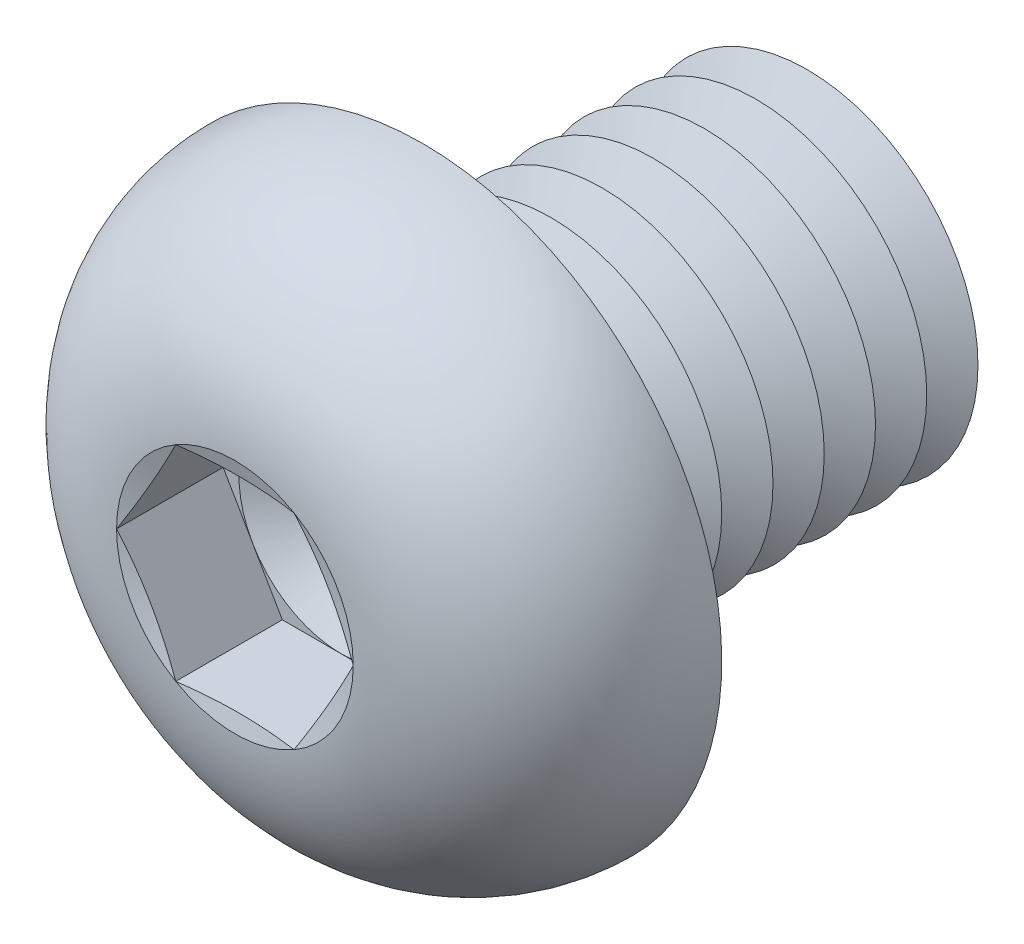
ISO-10303-21;
HEADER;
FILE_DESCRIPTION(('STEP AP214'),'2;1');
FILE_NAME('part.step','',(''),(''),'','','');
FILE_SCHEMA(('AUTOMOTIVE_DESIGN { 1 0 10303 214 1 1 1 1 }'));
ENDSEC;
DATA;
#1=APPLICATION_CONTEXT('core data for automotive mechanical design processes');
#2=APPLICATION_PROTOCOL_DEFINITION('international standard','automotive_design',2000,#1);
#3=PRODUCT_CONTEXT('',#1,'mechanical');
#4=PRODUCT('Part','Part','',(#3));
#5=PRODUCT_RELATED_PRODUCT_CATEGORY('part','',(#4));
#6=PRODUCT_DEFINITION_FORMATION('','',#4);
#7=PRODUCT_DEFINITION_CONTEXT('part definition',#1,'design');
#8=PRODUCT_DEFINITION('design','',#6,#7);
#9=PRODUCT_DEFINITION_SHAPE('','',#8);
#10=(LENGTH_UNIT() NAMED_UNIT(*) SI_UNIT(.MILLI.,.METRE.));
#11=(NAMED_UNIT(*) PLANE_ANGLE_UNIT() SI_UNIT($,.RADIAN.));
#12=(NAMED_UNIT(*) SI_UNIT($,.STERADIAN.) SOLID_ANGLE_UNIT());
#13=UNCERTAINTY_MEASURE_WITH_UNIT(LENGTH_MEASURE(1.E-05),#10,'distance_accuracy_value','');
#14=(GEOMETRIC_REPRESENTATION_CONTEXT(3) GLOBAL_UNCERTAINTY_ASSIGNED_CONTEXT((#13)) GLOBAL_UNIT_ASSIGNED_CONTEXT((#10,
#11,#12)) REPRESENTATION_CONTEXT('',''));
#15=CARTESIAN_POINT('',(0.,0.,0.));
#16=DIRECTION('',(0.,0.,1.));
#17=DIRECTION('',(1.,0.,0.));
#18=AXIS2_PLACEMENT_3D('',#15,#16,#17);
#19=CARTESIAN_POINT('',(0.,0.,2.38));
#20=DIRECTION('',(0.,0.,1.));
#21=DIRECTION('',(1.,0.,0.));
#22=AXIS2_PLACEMENT_3D('',#19,#20,#21);
#23=PLANE('',#22);
#24=CARTESIAN_POINT('',(0.,0.,2.38));
#25=DIRECTION('',(0.,0.,1.));
#26=DIRECTION('',(1.,0.,0.));
#27=AXIS2_PLACEMENT_3D('',#24,#25,#26);
#28=CIRCLE('',#27,2.99999860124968);
#29=CARTESIAN_POINT('',(2.598075,1.49999930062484,2.38));
#30=VERTEX_POINT('',#29);
#31=CARTESIAN_POINT('',(0.,2.99999860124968,2.38));
#32=VERTEX_POINT('',#31);
#33=EDGE_CURVE('E118',#30,#32,#28,.T.);
#34=ORIENTED_EDGE('',*,*,#33,.F.);
#35=DIRECTION('',(-0.5,0.866025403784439,0.));
#36=VECTOR('',#35,1.);
#37=CARTESIAN_POINT('',(3.46410000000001,0.,2.38));
#38=LINE('',#37,#36);
#39=CARTESIAN_POINT('',(1.73205,2.99999860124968,2.38));
#40=VERTEX_POINT('',#39);
#41=EDGE_CURVE('E125',#30,#40,#38,.T.);
#42=ORIENTED_EDGE('',*,*,#41,.T.);
#43=DIRECTION('',(-1.,0.,0.));
#44=VECTOR('',#43,1.);
#45=CARTESIAN_POINT('',(1.73205,2.99999860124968,2.38));
#46=LINE('',#45,#44);
#47=EDGE_CURVE('E136',#40,#32,#46,.T.);
#48=ORIENTED_EDGE('',*,*,#47,.T.);
#49=EDGE_LOOP('',(#34,#42,#48));
#50=FACE_BOUND('',#49,.T.);
#51=ADVANCED_FACE('F39',(#50),#23,.T.);
#52=CARTESIAN_POINT('',(0.,0.,2.38));
#53=DIRECTION('',(0.,0.,1.));
#54=DIRECTION('',(1.,0.,0.));
#55=AXIS2_PLACEMENT_3D('',#52,#53,#54);
#56=CIRCLE('',#55,2.99999860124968);
#57=CARTESIAN_POINT('',(-2.598075,1.49999930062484,2.38));
#58=VERTEX_POINT('',#57);
#59=EDGE_CURVE('E11',#32,#58,#56,.T.);
#60=ORIENTED_EDGE('',*,*,#59,.F.);
#61=CARTESIAN_POINT('',(-1.73205,2.99999860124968,2.38));
#62=VERTEX_POINT('',#61);
#63=EDGE_CURVE('E131',#32,#62,#46,.T.);
#64=ORIENTED_EDGE('',*,*,#63,.T.);
#65=DIRECTION('',(-0.5,-0.866025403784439,0.));
#66=VECTOR('',#65,1.);
#67=CARTESIAN_POINT('',(-1.73205,2.99999860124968,2.38));
#68=LINE('',#67,#66);
#69=EDGE_CURVE('E134',#62,#58,#68,.T.);
#70=ORIENTED_EDGE('',*,*,#69,.T.);
#71=EDGE_LOOP('',(#60,#64,#70));
#72=FACE_BOUND('',#71,.T.);
#73=ADVANCED_FACE('F130',(#72),#23,.T.);
#74=CARTESIAN_POINT('',(-2.598075,-1.49999930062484,2.38));
#75=VERTEX_POINT('',#74);
#76=EDGE_CURVE('E49',#58,#75,#56,.T.);
#77=ORIENTED_EDGE('',*,*,#76,.F.);
#78=CARTESIAN_POINT('',(-3.46410000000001,0.,2.38));
#79=VERTEX_POINT('',#78);
#80=EDGE_CURVE('E143',#58,#79,#68,.T.);
#81=ORIENTED_EDGE('',*,*,#80,.T.);
#82=DIRECTION('',(0.5,-0.866025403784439,0.));
#83=VECTOR('',#82,1.);
#84=CARTESIAN_POINT('',(-3.46410000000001,0.,2.38));
#85=LINE('',#84,#83);
#86=EDGE_CURVE('E152',#79,#75,#85,.T.);
#87=ORIENTED_EDGE('',*,*,#86,.T.);
#88=EDGE_LOOP('',(#77,#81,#87));
#89=FACE_BOUND('',#88,.T.);
#90=ADVANCED_FACE('F407',(#89),#23,.T.);
#91=CARTESIAN_POINT('',(0.,-2.99999860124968,2.38));
#92=VERTEX_POINT('',#91);
#93=EDGE_CURVE('E395',#75,#92,#56,.T.);
#94=ORIENTED_EDGE('',*,*,#93,.F.);
#95=CARTESIAN_POINT('',(-1.73205,-2.99999860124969,2.38));
#96=VERTEX_POINT('',#95);
#97=EDGE_CURVE('E151',#75,#96,#85,.T.);
#98=ORIENTED_EDGE('',*,*,#97,.T.);
#99=DIRECTION('',(1.,0.,0.));
#100=VECTOR('',#99,1.);
#101=CARTESIAN_POINT('',(-1.73205,-2.99999860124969,2.38));
#102=LINE('',#101,#100);
#103=EDGE_CURVE('E157',#96,#92,#102,.T.);
#104=ORIENTED_EDGE('',*,*,#103,.T.);
#105=EDGE_LOOP('',(#94,#98,#104));
#106=FACE_BOUND('',#105,.T.);
#107=ADVANCED_FACE('F402',(#106),#23,.T.);
#108=CARTESIAN_POINT('',(2.59807500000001,-1.49999930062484,2.38));
#109=VERTEX_POINT('',#108);
#110=EDGE_CURVE('E56',#92,#109,#56,.T.);
#111=ORIENTED_EDGE('',*,*,#110,.F.);
#112=CARTESIAN_POINT('',(1.73205,-2.99999860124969,2.38));
#113=VERTEX_POINT('',#112);
#114=EDGE_CURVE('E156',#92,#113,#102,.T.);
#115=ORIENTED_EDGE('',*,*,#114,.T.);
#116=DIRECTION('',(0.5,0.866025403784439,0.));
#117=VECTOR('',#116,1.);
#118=CARTESIAN_POINT('',(1.73205,-2.99999860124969,2.38));
#119=LINE('',#118,#117);
#120=EDGE_CURVE('E162',#113,#109,#119,.T.);
#121=ORIENTED_EDGE('',*,*,#120,.T.);
#122=EDGE_LOOP('',(#111,#115,#121));
#123=FACE_BOUND('',#122,.T.);
#124=ADVANCED_FACE('F455',(#123),#23,.T.);
#125=CARTESIAN_POINT('',(0.,0.,5.49999999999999));
#126=DIRECTION('',(0.,0.,1.));
#127=DIRECTION('',(0.,-1.,0.));
#128=AXIS2_PLACEMENT_3D('',#125,#126,#127);
#129=CONICAL_SURFACE('',#128,3.46410000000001,1.30899693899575);
#130=CARTESIAN_POINT('',(3.46421547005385,-0.00020000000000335,5.50003094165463));
#131=CARTESIAN_POINT('',(3.39227822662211,0.124398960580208,5.48074619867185));
#132=CARTESIAN_POINT('',(3.32021054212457,0.249223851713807,5.46323875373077));
#133=CARTESIAN_POINT('',(3.17582062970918,0.499314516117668,5.43247971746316));
#134=CARTESIAN_POINT('',(3.10349831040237,0.624580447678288,5.41922985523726));
#135=CARTESIAN_POINT('',(2.95903767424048,0.874793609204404,5.39775958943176));
#136=CARTESIAN_POINT('',(2.88690033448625,0.999739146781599,5.38951357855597));
#137=CARTESIAN_POINT('',(2.7425336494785,1.24978958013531,5.37845651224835));
#138=CARTESIAN_POINT('',(2.67030432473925,1.37489444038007,5.37564440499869));
#139=CARTESIAN_POINT('',(2.52584567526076,1.6251041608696,5.37564440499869));
#140=CARTESIAN_POINT('',(2.45361635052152,1.75020902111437,5.37845651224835));
#141=CARTESIAN_POINT('',(2.30924966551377,2.00025945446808,5.38951357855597));
#142=CARTESIAN_POINT('',(2.23711232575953,2.12520499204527,5.39775958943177));
#143=CARTESIAN_POINT('',(2.09265168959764,2.37541815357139,5.41922985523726));
#144=CARTESIAN_POINT('',(2.02032937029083,2.50068408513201,5.43247971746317));
#145=CARTESIAN_POINT('',(1.87593945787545,2.75077474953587,5.46323875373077));
#146=CARTESIAN_POINT('',(1.8038717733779,2.87559964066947,5.48074619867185));
#147=CARTESIAN_POINT('',(1.73193452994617,3.00019860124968,5.50003094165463));
#148=B_SPLINE_CURVE_WITH_KNOTS('',3,(#130,#131,#132,#133,#134,#135,#136,#137,#138,#139,#140,
#141,#142,#143,#144,#145,#146,#147),.UNSPECIFIED.,.F.,.F.,(4,2,2,2,2,2,2,2,4),(0.,
0.435506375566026,0.871189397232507,1.30462357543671,1.73797384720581,2.1713241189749,
2.60475829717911,3.04044131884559,3.47594769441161),.UNSPECIFIED.);
#149=CARTESIAN_POINT('',(3.46410000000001,0.,5.5));
#150=VERTEX_POINT('',#149);
#151=CARTESIAN_POINT('',(1.73204999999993,2.99999860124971,5.5));
#152=VERTEX_POINT('',#151);
#153=EDGE_CURVE('E228',#150,#152,#148,.T.);
#154=ORIENTED_EDGE('',*,*,#153,.F.);
#155=CARTESIAN_POINT('',(0.,0.,5.49999999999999));
#156=DIRECTION('',(0.,0.,-1.));
#157=DIRECTION('',(0.,1.,0.));
#158=AXIS2_PLACEMENT_3D('',#155,#156,#157);
#159=CIRCLE('',#158,3.46410000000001);
#160=EDGE_CURVE('E307',#152,#150,#159,.T.);
#161=ORIENTED_EDGE('',*,*,#160,.F.);
#162=EDGE_LOOP('',(#154,#161));
#163=FACE_BOUND('',#162,.T.);
#164=ADVANCED_FACE('F422',(#163),#129,.F.);
#165=CARTESIAN_POINT('',(1.73193452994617,-3.00019860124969,5.50003094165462));
#166=CARTESIAN_POINT('',(1.8038717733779,-2.87559964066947,5.48074619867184));
#167=CARTESIAN_POINT('',(1.87593945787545,-2.75077474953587,5.46323875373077));
#168=CARTESIAN_POINT('',(2.02032937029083,-2.50068408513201,5.43247971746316));
#169=CARTESIAN_POINT('',(2.09265168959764,-2.37541815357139,5.41922985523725));
#170=CARTESIAN_POINT('',(2.23711232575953,-2.12520499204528,5.39775958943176));
#171=CARTESIAN_POINT('',(2.30924966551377,-2.00025945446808,5.38951357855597));
#172=CARTESIAN_POINT('',(2.45361635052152,-1.75020902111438,5.37845651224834));
#173=CARTESIAN_POINT('',(2.52584567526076,-1.62510416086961,5.37564440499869));
#174=CARTESIAN_POINT('',(2.67030432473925,-1.37489444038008,5.37564440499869));
#175=CARTESIAN_POINT('',(2.7425336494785,-1.24978958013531,5.37845651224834));
#176=CARTESIAN_POINT('',(2.88690033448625,-0.999739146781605,5.38951357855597));
#177=CARTESIAN_POINT('',(2.95903767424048,-0.874793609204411,5.39775958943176));
#178=CARTESIAN_POINT('',(3.10349831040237,-0.624580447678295,5.41922985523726));
#179=CARTESIAN_POINT('',(3.17582062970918,-0.499314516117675,5.43247971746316));
#180=CARTESIAN_POINT('',(3.32021054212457,-0.249223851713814,5.46323875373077));
#181=CARTESIAN_POINT('',(3.39227822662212,-0.124398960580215,5.48074619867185));
#182=CARTESIAN_POINT('',(3.46421547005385,0.00019999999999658,5.50003094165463));
#183=B_SPLINE_CURVE_WITH_KNOTS('',3,(#165,#166,#167,#168,#169,#170,#171,#172,#173,#174,#175,
#176,#177,#178,#179,#180,#181,#182),.UNSPECIFIED.,.F.,.F.,(4,2,2,2,2,2,2,2,4),(0.,
0.435506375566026,0.871189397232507,1.30462357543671,1.73797384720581,2.1713241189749,
2.6047582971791,3.04044131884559,3.47594769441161),.UNSPECIFIED.);
#184=CARTESIAN_POINT('',(1.73205,-2.99999860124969,5.5));
#185=VERTEX_POINT('',#184);
#186=EDGE_CURVE('E231',#185,#150,#183,.T.);
#187=ORIENTED_EDGE('',*,*,#186,.F.);
#188=EDGE_CURVE('E290',#150,#185,#159,.T.);
#189=ORIENTED_EDGE('',*,*,#188,.F.);
#190=EDGE_LOOP('',(#187,#189));
#191=FACE_BOUND('',#190,.T.);
#192=ADVANCED_FACE('F288',(#191),#129,.F.);
#193=CARTESIAN_POINT('',(-5.22730063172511,-2.99999860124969,6.18672552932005));
#194=CARTESIAN_POINT('',(-5.10075887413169,-2.99999860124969,6.1573201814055));
#195=CARTESIAN_POINT('',(-4.97415993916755,-2.99999860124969,6.12816064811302));
#196=CARTESIAN_POINT('',(-4.72082394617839,-2.99999860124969,6.07043857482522));
#197=CARTESIAN_POINT('',(-4.5940868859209,-2.99999860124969,6.04187604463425));
#198=CARTESIAN_POINT('',(-4.21358997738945,-2.99999860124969,5.95723252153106));
#199=CARTESIAN_POINT('',(-3.95959339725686,-2.99999860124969,5.90220706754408));
#200=CARTESIAN_POINT('',(-3.44835573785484,-2.99999860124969,5.79574115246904));
#201=CARTESIAN_POINT('',(-3.1911065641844,-2.99999860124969,5.744339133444));
#202=CARTESIAN_POINT('',(-2.67540790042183,-2.99999860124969,5.64772994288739));
#203=CARTESIAN_POINT('',(-2.41695830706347,-2.99999860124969,5.60252331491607));
#204=CARTESIAN_POINT('',(-1.90555125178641,-2.99999860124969,5.52251897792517));
#205=CARTESIAN_POINT('',(-1.65263426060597,-2.99999860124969,5.48747285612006));
#206=CARTESIAN_POINT('',(-1.27220564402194,-2.99999860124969,5.44439602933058));
#207=CARTESIAN_POINT('',(-1.1452320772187,-2.99999860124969,5.43161987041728));
#208=CARTESIAN_POINT('',(-0.890973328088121,-2.99999860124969,5.40972605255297));
#209=CARTESIAN_POINT('',(-0.763688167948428,-2.99999860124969,5.40060814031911));
#210=CARTESIAN_POINT('',(-0.509442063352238,-2.99999860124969,5.38647457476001));
#211=CARTESIAN_POINT('',(-0.382482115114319,-2.99999860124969,5.38144125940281));
#212=CARTESIAN_POINT('',(-0.12846352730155,-2.99999860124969,5.37566637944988));
#213=CARTESIAN_POINT('',(-0.00140488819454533,-2.99999860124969,5.37492479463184));
#214=CARTESIAN_POINT('',(0.252672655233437,-2.99999860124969,5.37777315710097));
#215=CARTESIAN_POINT('',(0.379691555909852,-2.99999860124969,5.38136342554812));
#216=CARTESIAN_POINT('',(0.633540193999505,-2.99999860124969,5.39268816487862));
#217=CARTESIAN_POINT('',(0.760369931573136,-2.99999860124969,5.40042263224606));
#218=CARTESIAN_POINT('',(1.06836981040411,-2.99999860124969,5.42382465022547));
#219=CARTESIAN_POINT('',(1.24938929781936,-2.99999860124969,5.4414748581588));
#220=CARTESIAN_POINT('',(1.61066786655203,-2.99999860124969,5.48312309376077));
#221=CARTESIAN_POINT('',(1.7909269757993,-2.99999860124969,5.50712088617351));
#222=CARTESIAN_POINT('',(2.15127612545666,-2.99999860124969,5.56013471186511));
#223=CARTESIAN_POINT('',(2.33136383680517,-2.99999860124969,5.58916634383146));
#224=CARTESIAN_POINT('',(2.69089203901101,-2.99999860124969,5.65100028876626));
#225=CARTESIAN_POINT('',(2.87033249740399,-2.99999860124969,5.6838027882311));
#226=CARTESIAN_POINT('',(3.23235399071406,-2.99999860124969,5.75295369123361));
#227=CARTESIAN_POINT('',(3.41492365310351,-2.99999860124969,5.78936117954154));
#228=CARTESIAN_POINT('',(3.77960351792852,-2.99999860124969,5.86440648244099));
#229=CARTESIAN_POINT('',(3.96171371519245,-2.99999860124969,5.90304432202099));
#230=CARTESIAN_POINT('',(4.32457472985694,-2.99999860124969,5.98179660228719));
#231=CARTESIAN_POINT('',(4.50532755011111,-2.99999860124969,6.02190185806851));
#232=CARTESIAN_POINT('',(4.86652484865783,-2.99999860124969,6.10342152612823));
#233=CARTESIAN_POINT('',(5.04696934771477,-2.99999860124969,6.14483584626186));
#234=CARTESIAN_POINT('',(5.22730063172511,-2.99999860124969,6.18672552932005));
#235=B_SPLINE_CURVE_WITH_KNOTS('',3,(#193,#194,#195,#196,#197,#198,#199,#200,#201,#202,#203,
#204,#205,#206,#207,#208,#209,#210,#211,#212,#213,#214,#215,#216,#217,#218,#219,#220,#221,#222,
#223,#224,#225,#226,#227,#228,#229,#230,#231,#232,#233,#234),.UNSPECIFIED.,.F.,.F.,(4,2,2,2,2,2,
2,2,2,2,2,2,2,2,2,2,2,2,2,2,4),(0.,0.389739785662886,0.779485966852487,1.5591292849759,
2.34608117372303,3.13310206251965,3.89884102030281,4.28164148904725,4.66441544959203,
5.04552531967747,5.42663339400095,5.80776972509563,6.18890573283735,6.73438998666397,
7.2798540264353,7.82703956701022,8.3742521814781,8.93272720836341,9.49120849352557,
10.0466490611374,10.6020506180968),.UNSPECIFIED.);
#236=CARTESIAN_POINT('',(-1.73205,-2.99999860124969,5.5));
#237=VERTEX_POINT('',#236);
#238=EDGE_CURVE('E241',#237,#185,#235,.T.);
#239=ORIENTED_EDGE('',*,*,#238,.F.);
#240=EDGE_CURVE('E295',#185,#237,#159,.T.);
#241=ORIENTED_EDGE('',*,*,#240,.F.);
#242=EDGE_LOOP('',(#239,#241));
#243=FACE_BOUND('',#242,.T.);
#244=ADVANCED_FACE('F296',(#243),#129,.F.);
#245=CARTESIAN_POINT('',(-3.46421547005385,0.000199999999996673,5.50003094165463));
#246=CARTESIAN_POINT('',(-3.39227822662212,-0.124398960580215,5.48074619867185));
#247=CARTESIAN_POINT('',(-3.32021054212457,-0.249223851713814,5.46323875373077));
#248=CARTESIAN_POINT('',(-3.17582062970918,-0.499314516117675,5.43247971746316));
#249=CARTESIAN_POINT('',(-3.10349831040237,-0.624580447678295,5.41922985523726));
#250=CARTESIAN_POINT('',(-2.95903767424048,-0.87479360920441,5.39775958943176));
#251=CARTESIAN_POINT('',(-2.88690033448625,-0.999739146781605,5.38951357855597));
#252=CARTESIAN_POINT('',(-2.7425336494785,-1.24978958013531,5.37845651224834));
#253=CARTESIAN_POINT('',(-2.67030432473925,-1.37489444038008,5.37564440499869));
#254=CARTESIAN_POINT('',(-2.52584567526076,-1.62510416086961,5.37564440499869));
#255=CARTESIAN_POINT('',(-2.45361635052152,-1.75020902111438,5.37845651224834));
#256=CARTESIAN_POINT('',(-2.30924966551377,-2.00025945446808,5.38951357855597));
#257=CARTESIAN_POINT('',(-2.23711232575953,-2.12520499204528,5.39775958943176));
#258=CARTESIAN_POINT('',(-2.09265168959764,-2.37541815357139,5.41922985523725));
#259=CARTESIAN_POINT('',(-2.02032937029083,-2.50068408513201,5.43247971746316));
#260=CARTESIAN_POINT('',(-1.87593945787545,-2.75077474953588,5.46323875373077));
#261=CARTESIAN_POINT('',(-1.8038717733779,-2.87559964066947,5.48074619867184));
#262=CARTESIAN_POINT('',(-1.73193452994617,-3.00019860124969,5.50003094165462));
#263=B_SPLINE_CURVE_WITH_KNOTS('',3,(#245,#246,#247,#248,#249,#250,#251,#252,#253,#254,#255,
#256,#257,#258,#259,#260,#261,#262),.UNSPECIFIED.,.F.,.F.,(4,2,2,2,2,2,2,2,4),(0.,
0.435506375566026,0.871189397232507,1.30462357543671,1.73797384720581,2.1713241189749,
2.60475829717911,3.04044131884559,3.47594769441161),.UNSPECIFIED.);
#264=CARTESIAN_POINT('',(-3.46410000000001,0.,5.5));
#265=VERTEX_POINT('',#264);
#266=EDGE_CURVE('E236',#265,#237,#263,.T.);
#267=ORIENTED_EDGE('',*,*,#266,.F.);
#268=EDGE_CURVE('E301',#237,#265,#159,.T.);
#269=ORIENTED_EDGE('',*,*,#268,.F.);
#270=EDGE_LOOP('',(#267,#269));
#271=FACE_BOUND('',#270,.T.);
#272=ADVANCED_FACE('F414',(#271),#129,.F.);
#273=CARTESIAN_POINT('',(-1.73193452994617,3.00019860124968,5.50003094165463));
#274=CARTESIAN_POINT('',(-1.8038717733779,2.87559964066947,5.48074619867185));
#275=CARTESIAN_POINT('',(-1.87593945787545,2.75077474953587,5.46323875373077));
#276=CARTESIAN_POINT('',(-2.02032937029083,2.50068408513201,5.43247971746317));
#277=CARTESIAN_POINT('',(-2.09265168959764,2.37541815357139,5.41922985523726));
#278=CARTESIAN_POINT('',(-2.23711232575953,2.12520499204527,5.39775958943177));
#279=CARTESIAN_POINT('',(-2.30924966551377,2.00025945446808,5.38951357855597));
#280=CARTESIAN_POINT('',(-2.45361635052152,1.75020902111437,5.37845651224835));
#281=CARTESIAN_POINT('',(-2.52584567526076,1.6251041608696,5.37564440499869));
#282=CARTESIAN_POINT('',(-2.67030432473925,1.37489444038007,5.37564440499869));
#283=CARTESIAN_POINT('',(-2.7425336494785,1.24978958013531,5.37845651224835));
#284=CARTESIAN_POINT('',(-2.88690033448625,0.999739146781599,5.38951357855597));
#285=CARTESIAN_POINT('',(-2.95903767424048,0.874793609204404,5.39775958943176));
#286=CARTESIAN_POINT('',(-3.10349831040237,0.624580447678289,5.41922985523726));
#287=CARTESIAN_POINT('',(-3.17582062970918,0.499314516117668,5.43247971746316));
#288=CARTESIAN_POINT('',(-3.32021054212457,0.249223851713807,5.46323875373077));
#289=CARTESIAN_POINT('',(-3.39227822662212,0.124398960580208,5.48074619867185));
#290=CARTESIAN_POINT('',(-3.46421547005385,-0.000200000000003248,5.50003094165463));
#291=B_SPLINE_CURVE_WITH_KNOTS('',3,(#273,#274,#275,#276,#277,#278,#279,#280,#281,#282,#283,
#284,#285,#286,#287,#288,#289,#290),.UNSPECIFIED.,.F.,.F.,(4,2,2,2,2,2,2,2,4),(0.,
0.435506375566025,0.871189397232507,1.30462357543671,1.73797384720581,2.1713241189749,
2.6047582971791,3.04044131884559,3.47594769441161),.UNSPECIFIED.);
#292=CARTESIAN_POINT('',(-1.73205,2.99999860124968,5.5));
#293=VERTEX_POINT('',#292);
#294=EDGE_CURVE('E233',#293,#265,#291,.T.);
#295=ORIENTED_EDGE('',*,*,#294,.F.);
#296=EDGE_CURVE('E320',#265,#293,#159,.T.);
#297=ORIENTED_EDGE('',*,*,#296,.F.);
#298=EDGE_LOOP('',(#295,#297));
#299=FACE_BOUND('',#298,.T.);
#300=ADVANCED_FACE('F416',(#299),#129,.F.);
#301=CARTESIAN_POINT('',(0.,0.,-6.75));
#302=DIRECTION('',(0.,0.,1.));
#303=DIRECTION('',(0.,-1.,0.));
#304=AXIS2_PLACEMENT_3D('',#301,#302,#303);
#305=CONICAL_SURFACE('',#304,4.99999999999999,1.0471975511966);
#306=CARTESIAN_POINT('',(0.,0.,-7.5));
#307=DIRECTION('',(0.,0.,1.));
#308=DIRECTION('',(0.,-1.,0.));
#309=AXIS2_PLACEMENT_3D('',#306,#307,#308);
#310=CIRCLE('',#309,3.70096189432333);
#311=CARTESIAN_POINT('',(0.,-3.70096189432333,-7.5));
#312=VERTEX_POINT('',#311);
#313=EDGE_CURVE('E350',#312,#312,#310,.T.);
#314=ORIENTED_EDGE('',*,*,#313,.T.);
#315=EDGE_LOOP('',(#314));
#316=FACE_BOUND('',#315,.T.);
#317=CARTESIAN_POINT('',(0.,0.,-6.75));
#318=DIRECTION('',(0.,0.,1.));
#319=DIRECTION('',(0.,-1.,0.));
#320=AXIS2_PLACEMENT_3D('',#317,#318,#319);
#321=CIRCLE('',#320,4.99999999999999);
#322=CARTESIAN_POINT('',(0.,-4.99999999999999,-6.75));
#323=VERTEX_POINT('',#322);
#324=EDGE_CURVE('E344',#323,#323,#321,.T.);
#325=ORIENTED_EDGE('',*,*,#324,.F.);
#326=EDGE_LOOP('',(#325));
#327=FACE_BOUND('',#326,.T.);
#328=ADVANCED_FACE('F504',(#316,#327),#305,.T.);
#329=CARTESIAN_POINT('',(0.,0.,-7.5));
#330=DIRECTION('',(0.,0.,-1.));
#331=DIRECTION('',(0.,1.,0.));
#332=AXIS2_PLACEMENT_3D('',#329,#330,#331);
#333=CONICAL_SURFACE('',#332,3.70096189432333,1.0471975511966);
#334=CARTESIAN_POINT('',(0.,0.,-8.25));
#335=DIRECTION('',(0.,0.,1.));
#336=DIRECTION('',(0.,-1.,0.));
#337=AXIS2_PLACEMENT_3D('',#334,#335,#336);
#338=CIRCLE('',#337,4.99999999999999);
#339=CARTESIAN_POINT('',(0.,-4.99999999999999,-8.25));
#340=VERTEX_POINT('',#339);
#341=EDGE_CURVE('E361',#340,#340,#338,.T.);
#342=ORIENTED_EDGE('',*,*,#341,.T.);
#343=EDGE_LOOP('',(#342));
#344=FACE_BOUND('',#343,.T.);
#345=ORIENTED_EDGE('',*,*,#313,.F.);
#346=EDGE_LOOP('',(#345));
#347=FACE_BOUND('',#346,.T.);
#348=ADVANCED_FACE('F647',(#344,#347),#333,.T.);
#349=CARTESIAN_POINT('',(0.,4.99999999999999,-12.));
#350=DIRECTION('',(0.,0.,-1.));
#351=DIRECTION('',(0.,1.,0.));
#352=AXIS2_PLACEMENT_3D('',#349,#350,#351);
#353=PLANE('',#352);
#354=CARTESIAN_POINT('',(0.,0.,-12.));
#355=DIRECTION('',(0.,0.,1.));
#356=DIRECTION('',(0.,-1.,0.));
#357=AXIS2_PLACEMENT_3D('',#354,#355,#356);
#358=CIRCLE('',#357,3.70096189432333);
#359=CARTESIAN_POINT('',(0.,-3.70096189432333,-12.));
#360=VERTEX_POINT('',#359);
#361=EDGE_CURVE('E326',#360,#360,#358,.T.);
#362=ORIENTED_EDGE('',*,*,#361,.F.);
#363=EDGE_LOOP('',(#362));
#364=FACE_BOUND('',#363,.T.);
#365=ADVANCED_FACE('F652',(#364),#353,.T.);
#366=CARTESIAN_POINT('',(0.,0.,-11.25));
#367=DIRECTION('',(0.,0.,1.));
#368=DIRECTION('',(0.,-1.,0.));
#369=AXIS2_PLACEMENT_3D('',#366,#367,#368);
#370=CONICAL_SURFACE('',#369,4.99999999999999,1.0471975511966);
#371=ORIENTED_EDGE('',*,*,#361,.T.);
#372=EDGE_LOOP('',(#371));
#373=FACE_BOUND('',#372,.T.);
#374=CARTESIAN_POINT('',(0.,0.,-11.25));
#375=DIRECTION('',(0.,0.,1.));
#376=DIRECTION('',(0.,-1.,0.));
#377=AXIS2_PLACEMENT_3D('',#374,#375,#376);
#378=CIRCLE('',#377,4.99999999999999);
#379=CARTESIAN_POINT('',(0.,-4.99999999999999,-11.25));
#380=VERTEX_POINT('',#379);
#381=EDGE_CURVE('E377',#380,#380,#378,.T.);
#382=ORIENTED_EDGE('',*,*,#381,.F.);
#383=EDGE_LOOP('',(#382));
#384=FACE_BOUND('',#383,.T.);
#385=ADVANCED_FACE('F640',(#373,#384),#370,.T.);
#386=CARTESIAN_POINT('',(0.,0.,-10.5));
#387=DIRECTION('',(0.,0.,-1.));
#388=DIRECTION('',(0.,1.,0.));
#389=AXIS2_PLACEMENT_3D('',#386,#387,#388);
#390=CONICAL_SURFACE('',#389,3.70096189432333,1.0471975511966);
#391=ORIENTED_EDGE('',*,*,#381,.T.);
#392=EDGE_LOOP('',(#391));
#393=FACE_BOUND('',#392,.T.);
#394=CARTESIAN_POINT('',(0.,0.,-10.5));
#395=DIRECTION('',(0.,0.,1.));
#396=DIRECTION('',(0.,-1.,0.));
#397=AXIS2_PLACEMENT_3D('',#394,#395,#396);
#398=CIRCLE('',#397,3.70096189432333);
#399=CARTESIAN_POINT('',(0.,-3.70096189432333,-10.5));
#400=VERTEX_POINT('',#399);
#401=EDGE_CURVE('E373',#400,#400,#398,.T.);
#402=ORIENTED_EDGE('',*,*,#401,.F.);
#403=EDGE_LOOP('',(#402));
#404=FACE_BOUND('',#403,.T.);
#405=ADVANCED_FACE('F630',(#393,#404),#390,.T.);
#406=CARTESIAN_POINT('',(0.,0.,-9.75));
#407=DIRECTION('',(0.,0.,1.));
#408=DIRECTION('',(0.,-1.,0.));
#409=AXIS2_PLACEMENT_3D('',#406,#407,#408);
#410=CONICAL_SURFACE('',#409,4.99999999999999,1.0471975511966);
#411=ORIENTED_EDGE('',*,*,#401,.T.);
#412=EDGE_LOOP('',(#411));
#413=FACE_BOUND('',#412,.T.);
#414=CARTESIAN_POINT('',(0.,0.,-9.75));
#415=DIRECTION('',(0.,0.,1.));
#416=DIRECTION('',(0.,-1.,0.));
#417=AXIS2_PLACEMENT_3D('',#414,#415,#416);
#418=CIRCLE('',#417,4.99999999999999);
#419=CARTESIAN_POINT('',(0.,-4.99999999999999,-9.75));
#420=VERTEX_POINT('',#419);
#421=EDGE_CURVE('E369',#420,#420,#418,.T.);
#422=ORIENTED_EDGE('',*,*,#421,.F.);
#423=EDGE_LOOP('',(#422));
#424=FACE_BOUND('',#423,.T.);
#425=ADVANCED_FACE('F620',(#413,#424),#410,.T.);
#426=CARTESIAN_POINT('',(0.,0.,-9.));
#427=DIRECTION('',(0.,0.,-1.));
#428=DIRECTION('',(0.,1.,0.));
#429=AXIS2_PLACEMENT_3D('',#426,#427,#428);
#430=CONICAL_SURFACE('',#429,3.70096189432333,1.0471975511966);
#431=ORIENTED_EDGE('',*,*,#421,.T.);
#432=EDGE_LOOP('',(#431));
#433=FACE_BOUND('',#432,.T.);
#434=CARTESIAN_POINT('',(0.,0.,-9.));
#435=DIRECTION('',(0.,0.,1.));
#436=DIRECTION('',(0.,-1.,0.));
#437=AXIS2_PLACEMENT_3D('',#434,#435,#436);
#438=CIRCLE('',#437,3.70096189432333);
#439=CARTESIAN_POINT('',(0.,-3.70096189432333,-9.));
#440=VERTEX_POINT('',#439);
#441=EDGE_CURVE('E365',#440,#440,#438,.T.);
#442=ORIENTED_EDGE('',*,*,#441,.F.);
#443=EDGE_LOOP('',(#442));
#444=FACE_BOUND('',#443,.T.);
#445=ADVANCED_FACE('F610',(#433,#444),#430,.T.);
#446=CARTESIAN_POINT('',(0.,0.,-8.25));
#447=DIRECTION('',(0.,0.,1.));
#448=DIRECTION('',(0.,-1.,0.));
#449=AXIS2_PLACEMENT_3D('',#446,#447,#448);
#450=CONICAL_SURFACE('',#449,4.99999999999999,1.0471975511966);
#451=ORIENTED_EDGE('',*,*,#441,.T.);
#452=EDGE_LOOP('',(#451));
#453=FACE_BOUND('',#452,.T.);
#454=ORIENTED_EDGE('',*,*,#341,.F.);
#455=EDGE_LOOP('',(#454));
#456=FACE_BOUND('',#455,.T.);
#457=ADVANCED_FACE('F601',(#453,#456),#450,.T.);
#458=CARTESIAN_POINT('',(0.,0.,-5.25));
#459=DIRECTION('',(0.,0.,1.));
#460=DIRECTION('',(0.,-1.,0.));
#461=AXIS2_PLACEMENT_3D('',#458,#459,#460);
#462=CONICAL_SURFACE('',#461,4.99999999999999,1.0471975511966);
#463=CARTESIAN_POINT('',(0.,0.,-6.));
#464=DIRECTION('',(0.,0.,1.));
#465=DIRECTION('',(0.,-1.,0.));
#466=AXIS2_PLACEMENT_3D('',#463,#464,#465);
#467=CIRCLE('',#466,3.70096189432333);
#468=CARTESIAN_POINT('',(0.,-3.70096189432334,-6.));
#469=VERTEX_POINT('',#468);
#470=EDGE_CURVE('E342',#469,#469,#467,.T.);
#471=ORIENTED_EDGE('',*,*,#470,.T.);
#472=EDGE_LOOP('',(#471));
#473=FACE_BOUND('',#472,.T.);
#474=CARTESIAN_POINT('',(0.,0.,-5.25));
#475=DIRECTION('',(0.,0.,1.));
#476=DIRECTION('',(0.,-1.,0.));
#477=AXIS2_PLACEMENT_3D('',#474,#475,#476);
#478=CIRCLE('',#477,4.99999999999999);
#479=CARTESIAN_POINT('',(0.,-5.,-5.25));
#480=VERTEX_POINT('',#479);
#481=EDGE_CURVE('E345',#480,#480,#478,.T.);
#482=ORIENTED_EDGE('',*,*,#481,.F.);
#483=EDGE_LOOP('',(#482));
#484=FACE_BOUND('',#483,.T.);
#485=ADVANCED_FACE('F591',(#473,#484),#462,.T.);
#486=CARTESIAN_POINT('',(0.,0.,-6.));
#487=DIRECTION('',(0.,0.,-1.));
#488=DIRECTION('',(0.,1.,0.));
#489=AXIS2_PLACEMENT_3D('',#486,#487,#488);
#490=CONICAL_SURFACE('',#489,3.70096189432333,1.0471975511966);
#491=ORIENTED_EDGE('',*,*,#324,.T.);
#492=EDGE_LOOP('',(#491));
#493=FACE_BOUND('',#492,.T.);
#494=ORIENTED_EDGE('',*,*,#470,.F.);
#495=EDGE_LOOP('',(#494));
#496=FACE_BOUND('',#495,.T.);
#497=ADVANCED_FACE('F582',(#493,#496),#490,.T.);
#498=CARTESIAN_POINT('',(0.,0.,-3.75));
#499=DIRECTION('',(0.,0.,1.));
#500=DIRECTION('',(0.,-1.,0.));
#501=AXIS2_PLACEMENT_3D('',#498,#499,#500);
#502=CONICAL_SURFACE('',#501,4.99999999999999,1.0471975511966);
#503=CARTESIAN_POINT('',(0.,0.,-4.5));
#504=DIRECTION('',(0.,0.,1.));
#505=DIRECTION('',(0.,-1.,0.));
#506=AXIS2_PLACEMENT_3D('',#503,#504,#505);
#507=CIRCLE('',#506,3.70096189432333);
#508=CARTESIAN_POINT('',(0.,-3.70096189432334,-4.5));
#509=VERTEX_POINT('',#508);
#510=EDGE_CURVE('E354',#509,#509,#507,.T.);
#511=ORIENTED_EDGE('',*,*,#510,.T.);
#512=EDGE_LOOP('',(#511));
#513=FACE_BOUND('',#512,.T.);
#514=CARTESIAN_POINT('',(0.,0.,-3.75));
#515=DIRECTION('',(0.,0.,1.));
#516=DIRECTION('',(0.,-1.,0.));
#517=AXIS2_PLACEMENT_3D('',#514,#515,#516);
#518=CIRCLE('',#517,4.99999999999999);
#519=CARTESIAN_POINT('',(0.,-5.,-3.75));
#520=VERTEX_POINT('',#519);
#521=EDGE_CURVE('E340',#520,#520,#518,.T.);
#522=ORIENTED_EDGE('',*,*,#521,.F.);
#523=EDGE_LOOP('',(#522));
#524=FACE_BOUND('',#523,.T.);
#525=ADVANCED_FACE('F572',(#513,#524),#502,.T.);
#526=CARTESIAN_POINT('',(0.,0.,-4.5));
#527=DIRECTION('',(0.,0.,-1.));
#528=DIRECTION('',(0.,1.,0.));
#529=AXIS2_PLACEMENT_3D('',#526,#527,#528);
#530=CONICAL_SURFACE('',#529,3.70096189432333,1.0471975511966);
#531=ORIENTED_EDGE('',*,*,#481,.T.);
#532=EDGE_LOOP('',(#531));
#533=FACE_BOUND('',#532,.T.);
#534=ORIENTED_EDGE('',*,*,#510,.F.);
#535=EDGE_LOOP('',(#534));
#536=FACE_BOUND('',#535,.T.);
#537=ADVANCED_FACE('F562',(#533,#536),#530,.T.);
#538=CARTESIAN_POINT('',(0.,0.,-2.25));
#539=DIRECTION('',(0.,0.,1.));
#540=DIRECTION('',(0.,-1.,0.));
#541=AXIS2_PLACEMENT_3D('',#538,#539,#540);
#542=CONICAL_SURFACE('',#541,4.99999999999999,1.0471975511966);
#543=CARTESIAN_POINT('',(0.,0.,-3.));
#544=DIRECTION('',(0.,0.,1.));
#545=DIRECTION('',(0.,-1.,0.));
#546=AXIS2_PLACEMENT_3D('',#543,#544,#545);
#547=CIRCLE('',#546,3.70096189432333);
#548=CARTESIAN_POINT('',(0.,-3.70096189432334,-3.));
#549=VERTEX_POINT('',#548);
#550=EDGE_CURVE('E334',#549,#549,#547,.T.);
#551=ORIENTED_EDGE('',*,*,#550,.T.);
#552=EDGE_LOOP('',(#551));
#553=FACE_BOUND('',#552,.T.);
#554=CARTESIAN_POINT('',(0.,0.,-2.25));
#555=DIRECTION('',(0.,0.,1.));
#556=DIRECTION('',(0.,-1.,0.));
#557=AXIS2_PLACEMENT_3D('',#554,#555,#556);
#558=CIRCLE('',#557,4.99999999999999);
#559=CARTESIAN_POINT('',(0.,-5.,-2.25));
#560=VERTEX_POINT('',#559);
#561=EDGE_CURVE('E335',#560,#560,#558,.T.);
#562=ORIENTED_EDGE('',*,*,#561,.F.);
#563=EDGE_LOOP('',(#562));
#564=FACE_BOUND('',#563,.T.);
#565=ADVANCED_FACE('F552',(#553,#564),#542,.T.);
#566=CARTESIAN_POINT('',(0.,0.,-3.));
#567=DIRECTION('',(0.,0.,-1.));
#568=DIRECTION('',(0.,1.,0.));
#569=AXIS2_PLACEMENT_3D('',#566,#567,#568);
#570=CONICAL_SURFACE('',#569,3.70096189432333,1.0471975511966);
#571=ORIENTED_EDGE('',*,*,#521,.T.);
#572=EDGE_LOOP('',(#571));
#573=FACE_BOUND('',#572,.T.);
#574=ORIENTED_EDGE('',*,*,#550,.F.);
#575=EDGE_LOOP('',(#574));
#576=FACE_BOUND('',#575,.T.);
#577=ADVANCED_FACE('F448',(#573,#576),#570,.T.);
#578=CARTESIAN_POINT('',(0.,0.,-0.749999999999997));
#579=DIRECTION('',(0.,0.,1.));
#580=DIRECTION('',(0.,-1.,0.));
#581=AXIS2_PLACEMENT_3D('',#578,#579,#580);
#582=CONICAL_SURFACE('',#581,4.99999999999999,1.0471975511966);
#583=CARTESIAN_POINT('',(0.,0.,-1.5));
#584=DIRECTION('',(0.,0.,1.));
#585=DIRECTION('',(0.,-1.,0.));
#586=AXIS2_PLACEMENT_3D('',#583,#584,#585);
#587=CIRCLE('',#586,3.70096189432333);
#588=CARTESIAN_POINT('',(0.,-3.70096189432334,-1.5));
#589=VERTEX_POINT('',#588);
#590=EDGE_CURVE('E225',#589,#589,#587,.T.);
#591=ORIENTED_EDGE('',*,*,#590,.T.);
#592=EDGE_LOOP('',(#591));
#593=FACE_BOUND('',#592,.T.);
#594=CARTESIAN_POINT('',(0.,0.,-0.749999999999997));
#595=DIRECTION('',(0.,0.,1.));
#596=DIRECTION('',(0.,-1.,0.));
#597=AXIS2_PLACEMENT_3D('',#594,#595,#596);
#598=CIRCLE('',#597,4.99999999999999);
#599=CARTESIAN_POINT('',(0.,-5.,-0.75));
#600=VERTEX_POINT('',#599);
#601=EDGE_CURVE('E332',#600,#600,#598,.T.);
#602=ORIENTED_EDGE('',*,*,#601,.F.);
#603=EDGE_LOOP('',(#602));
#604=FACE_BOUND('',#603,.T.);
#605=ADVANCED_FACE('F440',(#593,#604),#582,.T.);
#606=CARTESIAN_POINT('',(0.,0.,-1.5));
#607=DIRECTION('',(0.,0.,-1.));
#608=DIRECTION('',(0.,1.,0.));
#609=AXIS2_PLACEMENT_3D('',#606,#607,#608);
#610=CONICAL_SURFACE('',#609,3.70096189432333,1.0471975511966);
#611=ORIENTED_EDGE('',*,*,#561,.T.);
#612=EDGE_LOOP('',(#611));
#613=FACE_BOUND('',#612,.T.);
#614=ORIENTED_EDGE('',*,*,#590,.F.);
#615=EDGE_LOOP('',(#614));
#616=FACE_BOUND('',#615,.T.);
#617=ADVANCED_FACE('F209',(#613,#616),#610,.T.);
#618=CARTESIAN_POINT('',(5.22730063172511,2.99999860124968,6.18672552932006));
#619=CARTESIAN_POINT('',(5.10075887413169,2.99999860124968,6.1573201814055));
#620=CARTESIAN_POINT('',(4.97415993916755,2.99999860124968,6.12816064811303));
#621=CARTESIAN_POINT('',(4.72082394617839,2.99999860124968,6.07043857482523));
#622=CARTESIAN_POINT('',(4.5940868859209,2.99999860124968,6.04187604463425));
#623=CARTESIAN_POINT('',(4.21358997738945,2.99999860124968,5.95723252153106));
#624=CARTESIAN_POINT('',(3.95959339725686,2.99999860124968,5.90220706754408));
#625=CARTESIAN_POINT('',(3.44835573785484,2.99999860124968,5.79574115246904));
#626=CARTESIAN_POINT('',(3.1911065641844,2.99999860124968,5.744339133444));
#627=CARTESIAN_POINT('',(2.67540790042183,2.99999860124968,5.64772994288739));
#628=CARTESIAN_POINT('',(2.41695830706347,2.99999860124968,5.60252331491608));
#629=CARTESIAN_POINT('',(1.90555125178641,2.99999860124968,5.52251897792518));
#630=CARTESIAN_POINT('',(1.65263426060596,2.99999860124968,5.48747285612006));
#631=CARTESIAN_POINT('',(1.27220564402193,2.99999860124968,5.44439602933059));
#632=CARTESIAN_POINT('',(1.1452320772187,2.99999860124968,5.43161987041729));
#633=CARTESIAN_POINT('',(0.890973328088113,2.99999860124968,5.40972605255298));
#634=CARTESIAN_POINT('',(0.76368816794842,2.99999860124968,5.40060814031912));
#635=CARTESIAN_POINT('',(0.50944206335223,2.99999860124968,5.38647457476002));
#636=CARTESIAN_POINT('',(0.382482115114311,2.99999860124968,5.38144125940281));
#637=CARTESIAN_POINT('',(0.128463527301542,2.99999860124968,5.37566637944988));
#638=CARTESIAN_POINT('',(0.00140488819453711,2.99999860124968,5.37492479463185));
#639=CARTESIAN_POINT('',(-0.252672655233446,2.99999860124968,5.37777315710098));
#640=CARTESIAN_POINT('',(-0.379691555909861,2.99999860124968,5.38136342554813));
#641=CARTESIAN_POINT('',(-0.633540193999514,2.99999860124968,5.39268816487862));
#642=CARTESIAN_POINT('',(-0.760369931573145,2.99999860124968,5.40042263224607));
#643=CARTESIAN_POINT('',(-1.06836981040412,2.99999860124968,5.42382465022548));
#644=CARTESIAN_POINT('',(-1.24938929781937,2.99999860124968,5.4414748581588));
#645=CARTESIAN_POINT('',(-1.61066786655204,2.99999860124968,5.48312309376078));
#646=CARTESIAN_POINT('',(-1.79092697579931,2.99999860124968,5.50712088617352));
#647=CARTESIAN_POINT('',(-2.15127612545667,2.99999860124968,5.56013471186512));
#648=CARTESIAN_POINT('',(-2.33136383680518,2.99999860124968,5.58916634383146));
#649=CARTESIAN_POINT('',(-2.69089203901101,2.99999860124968,5.65100028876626));
#650=CARTESIAN_POINT('',(-2.870332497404,2.99999860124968,5.68380278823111));
#651=CARTESIAN_POINT('',(-3.23235399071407,2.99999860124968,5.75295369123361));
#652=CARTESIAN_POINT('',(-3.41492365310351,2.99999860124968,5.78936117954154));
#653=CARTESIAN_POINT('',(-3.77960351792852,2.99999860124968,5.86440648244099));
#654=CARTESIAN_POINT('',(-3.96171371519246,2.99999860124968,5.903044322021));
#655=CARTESIAN_POINT('',(-4.32457472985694,2.99999860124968,5.98179660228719));
#656=CARTESIAN_POINT('',(-4.50532755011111,2.99999860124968,6.02190185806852));
#657=CARTESIAN_POINT('',(-4.86652484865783,2.99999860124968,6.10342152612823));
#658=CARTESIAN_POINT('',(-5.04696934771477,2.99999860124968,6.14483584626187));
#659=CARTESIAN_POINT('',(-5.22730063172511,2.99999860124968,6.18672552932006));
#660=B_SPLINE_CURVE_WITH_KNOTS('',3,(#618,#619,#620,#621,#622,#623,#624,#625,#626,#627,#628,
#629,#630,#631,#632,#633,#634,#635,#636,#637,#638,#639,#640,#641,#642,#643,#644,#645,#646,#647,
#648,#649,#650,#651,#652,#653,#654,#655,#656,#657,#658,#659),.UNSPECIFIED.,.F.,.F.,(4,2,2,2,2,2,
2,2,2,2,2,2,2,2,2,2,2,2,2,2,4),(0.,0.389739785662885,0.779485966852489,1.55912928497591,
2.34608117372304,3.13310206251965,3.89884102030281,4.28164148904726,4.66441544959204,
5.04552531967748,5.42663339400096,5.80776972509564,6.18890573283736,6.73438998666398,
7.27985402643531,7.82703956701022,8.37425218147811,8.93272720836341,9.49120849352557,
10.0466490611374,10.6020506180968),.UNSPECIFIED.);
#661=EDGE_CURVE('E170',#152,#293,#660,.T.);
#662=ORIENTED_EDGE('',*,*,#661,.F.);
#663=EDGE_CURVE('E323',#293,#152,#159,.T.);
#664=ORIENTED_EDGE('',*,*,#663,.F.);
#665=EDGE_LOOP('',(#662,#664));
#666=FACE_BOUND('',#665,.T.);
#667=ADVANCED_FACE('F193',(#666),#129,.F.);
#668=CARTESIAN_POINT('',(0.,0.,0.));
#669=DIRECTION('',(0.,0.,-1.));
#670=DIRECTION('',(0.,1.,0.));
#671=AXIS2_PLACEMENT_3D('',#668,#669,#670);
#672=DEGENERATE_TOROIDAL_SURFACE('',#671,3.24566404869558,5.50433595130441,.T.);
#673=ORIENTED_EDGE('',*,*,#160,.T.);
#674=ORIENTED_EDGE('',*,*,#188,.T.);
#675=ORIENTED_EDGE('',*,*,#240,.T.);
#676=ORIENTED_EDGE('',*,*,#268,.T.);
#677=ORIENTED_EDGE('',*,*,#296,.T.);
#678=ORIENTED_EDGE('',*,*,#663,.T.);
#679=EDGE_LOOP('',(#673,#674,#675,#676,#677,#678));
#680=FACE_BOUND('',#679,.T.);
#681=CARTESIAN_POINT('',(0.,0.,0.));
#682=DIRECTION('',(0.,0.,-1.));
#683=DIRECTION('',(0.,1.,0.));
#684=AXIS2_PLACEMENT_3D('',#681,#682,#683);
#685=CIRCLE('',#684,8.75);
#686=CARTESIAN_POINT('',(0.,8.74999999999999,0.));
#687=VERTEX_POINT('',#686);
#688=EDGE_CURVE('E313',#687,#687,#685,.T.);
#689=ORIENTED_EDGE('',*,*,#688,.F.);
#690=EDGE_LOOP('',(#689));
#691=FACE_BOUND('',#690,.T.);
#692=ADVANCED_FACE('F303',(#680,#691),#672,.T.);
#693=CARTESIAN_POINT('',(0.,4.99999999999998,0.));
#694=DIRECTION('',(0.,0.,-1.));
#695=DIRECTION('',(0.,1.,0.));
#696=AXIS2_PLACEMENT_3D('',#693,#694,#695);
#697=PLANE('',#696);
#698=CARTESIAN_POINT('',(0.,0.,0.));
#699=DIRECTION('',(0.,0.,-1.));
#700=DIRECTION('',(0.,1.,0.));
#701=AXIS2_PLACEMENT_3D('',#698,#699,#700);
#702=CIRCLE('',#701,5.74999999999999);
#703=CARTESIAN_POINT('',(0.,5.74999999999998,0.));
#704=VERTEX_POINT('',#703);
#705=EDGE_CURVE('E387',#704,#704,#702,.F.);
#706=ORIENTED_EDGE('',*,*,#705,.T.);
#707=EDGE_LOOP('',(#706));
#708=FACE_BOUND('',#707,.T.);
#709=ORIENTED_EDGE('',*,*,#688,.T.);
#710=EDGE_LOOP('',(#709));
#711=FACE_BOUND('',#710,.T.);
#712=ADVANCED_FACE('F487',(#708,#711),#697,.T.);
#713=CARTESIAN_POINT('',(0.,0.,-0.750000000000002));
#714=DIRECTION('',(0.,0.,-1.));
#715=DIRECTION('',(0.,1.,0.));
#716=AXIS2_PLACEMENT_3D('',#713,#714,#715);
#717=TOROIDAL_SURFACE('',#716,5.74999999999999,0.75);
#718=ORIENTED_EDGE('',*,*,#705,.F.);
#719=EDGE_LOOP('',(#718));
#720=FACE_BOUND('',#719,.T.);
#721=ORIENTED_EDGE('',*,*,#601,.T.);
#722=EDGE_LOOP('',(#721));
#723=FACE_BOUND('',#722,.T.);
#724=ADVANCED_FACE('F41',(#720,#723),#717,.F.);
#725=CARTESIAN_POINT('',(3.46410000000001,0.,2.38));
#726=DIRECTION('',(0.866025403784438,0.5,0.));
#727=DIRECTION('',(-0.5,0.866025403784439,0.));
#728=AXIS2_PLACEMENT_3D('',#725,#726,#727);
#729=PLANE('',#728);
#730=ORIENTED_EDGE('',*,*,#153,.T.);
#731=DIRECTION('',(0.,0.,1.));
#732=VECTOR('',#731,1.);
#733=CARTESIAN_POINT('',(1.73205,2.99999860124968,2.38));
#734=LINE('',#733,#732);
#735=EDGE_CURVE('E64',#40,#152,#734,.T.);
#736=ORIENTED_EDGE('',*,*,#735,.F.);
#737=ORIENTED_EDGE('',*,*,#41,.F.);
#738=CARTESIAN_POINT('',(3.46410000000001,0.,2.38));
#739=VERTEX_POINT('',#738);
#740=EDGE_CURVE('E140',#739,#30,#38,.T.);
#741=ORIENTED_EDGE('',*,*,#740,.F.);
#742=DIRECTION('',(0.,0.,1.));
#743=VECTOR('',#742,1.);
#744=CARTESIAN_POINT('',(3.46410000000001,0.,2.38));
#745=LINE('',#744,#743);
#746=EDGE_CURVE('E166',#739,#150,#745,.T.);
#747=ORIENTED_EDGE('',*,*,#746,.T.);
#748=EDGE_LOOP('',(#730,#736,#737,#741,#747));
#749=FACE_BOUND('',#748,.T.);
#750=ADVANCED_FACE('F203',(#749),#729,.F.);
#751=CARTESIAN_POINT('',(1.73205,-2.99999860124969,2.38));
#752=DIRECTION('',(0.866025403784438,-0.5,0.));
#753=DIRECTION('',(0.5,0.866025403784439,0.));
#754=AXIS2_PLACEMENT_3D('',#751,#752,#753);
#755=PLANE('',#754);
#756=ORIENTED_EDGE('',*,*,#186,.T.);
#757=ORIENTED_EDGE('',*,*,#746,.F.);
#758=EDGE_CURVE('E161',#109,#739,#119,.T.);
#759=ORIENTED_EDGE('',*,*,#758,.F.);
#760=ORIENTED_EDGE('',*,*,#120,.F.);
#761=DIRECTION('',(0.,0.,1.));
#762=VECTOR('',#761,1.);
#763=CARTESIAN_POINT('',(1.73205,-2.99999860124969,2.38));
#764=LINE('',#763,#762);
#765=EDGE_CURVE('E171',#113,#185,#764,.T.);
#766=ORIENTED_EDGE('',*,*,#765,.T.);
#767=EDGE_LOOP('',(#756,#757,#759,#760,#766));
#768=FACE_BOUND('',#767,.T.);
#769=ADVANCED_FACE('F207',(#768),#755,.F.);
#770=CARTESIAN_POINT('',(-1.73205,-2.99999860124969,2.38));
#771=DIRECTION('',(0.,-1.,0.));
#772=DIRECTION('',(0.,0.,-1.));
#773=AXIS2_PLACEMENT_3D('',#770,#771,#772);
#774=PLANE('',#773);
#775=ORIENTED_EDGE('',*,*,#238,.T.);
#776=ORIENTED_EDGE('',*,*,#765,.F.);
#777=ORIENTED_EDGE('',*,*,#114,.F.);
#778=ORIENTED_EDGE('',*,*,#103,.F.);
#779=DIRECTION('',(0.,0.,1.));
#780=VECTOR('',#779,1.);
#781=CARTESIAN_POINT('',(-1.73205,-2.99999860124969,2.38));
#782=LINE('',#781,#780);
#783=EDGE_CURVE('E176',#96,#237,#782,.T.);
#784=ORIENTED_EDGE('',*,*,#783,.T.);
#785=EDGE_LOOP('',(#775,#776,#777,#778,#784));
#786=FACE_BOUND('',#785,.T.);
#787=ADVANCED_FACE('F251',(#786),#774,.F.);
#788=CARTESIAN_POINT('',(-3.46410000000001,0.,2.38));
#789=DIRECTION('',(-0.866025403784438,-0.5,0.));
#790=DIRECTION('',(0.5,-0.866025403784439,0.));
#791=AXIS2_PLACEMENT_3D('',#788,#789,#790);
#792=PLANE('',#791);
#793=ORIENTED_EDGE('',*,*,#266,.T.);
#794=ORIENTED_EDGE('',*,*,#783,.F.);
#795=ORIENTED_EDGE('',*,*,#97,.F.);
#796=ORIENTED_EDGE('',*,*,#86,.F.);
#797=DIRECTION('',(0.,0.,1.));
#798=VECTOR('',#797,1.);
#799=CARTESIAN_POINT('',(-3.46410000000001,0.,2.38));
#800=LINE('',#799,#798);
#801=EDGE_CURVE('E172',#79,#265,#800,.T.);
#802=ORIENTED_EDGE('',*,*,#801,.T.);
#803=EDGE_LOOP('',(#793,#794,#795,#796,#802));
#804=FACE_BOUND('',#803,.T.);
#805=ADVANCED_FACE('F254',(#804),#792,.F.);
#806=CARTESIAN_POINT('',(-1.73205,2.99999860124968,2.38));
#807=DIRECTION('',(-0.866025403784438,0.5,0.));
#808=DIRECTION('',(-0.5,-0.866025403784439,0.));
#809=AXIS2_PLACEMENT_3D('',#806,#807,#808);
#810=PLANE('',#809);
#811=ORIENTED_EDGE('',*,*,#294,.T.);
#812=ORIENTED_EDGE('',*,*,#801,.F.);
#813=ORIENTED_EDGE('',*,*,#80,.F.);
#814=ORIENTED_EDGE('',*,*,#69,.F.);
#815=DIRECTION('',(0.,0.,1.));
#816=VECTOR('',#815,1.);
#817=CARTESIAN_POINT('',(-1.73205,2.99999860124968,2.38));
#818=LINE('',#817,#816);
#819=EDGE_CURVE('E138',#62,#293,#818,.T.);
#820=ORIENTED_EDGE('',*,*,#819,.T.);
#821=EDGE_LOOP('',(#811,#812,#813,#814,#820));
#822=FACE_BOUND('',#821,.T.);
#823=ADVANCED_FACE('F200',(#822),#810,.F.);
#824=CARTESIAN_POINT('',(1.73205,2.99999860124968,2.38));
#825=DIRECTION('',(0.,1.,0.));
#826=DIRECTION('',(-1.,0.,0.));
#827=AXIS2_PLACEMENT_3D('',#824,#825,#826);
#828=PLANE('',#827);
#829=ORIENTED_EDGE('',*,*,#661,.T.);
#830=ORIENTED_EDGE('',*,*,#819,.F.);
#831=ORIENTED_EDGE('',*,*,#63,.F.);
#832=ORIENTED_EDGE('',*,*,#47,.F.);
#833=ORIENTED_EDGE('',*,*,#735,.T.);
#834=EDGE_LOOP('',(#829,#830,#831,#832,#833));
#835=FACE_BOUND('',#834,.T.);
#836=ADVANCED_FACE('F135',(#835),#828,.F.);
#837=EDGE_CURVE('E43',#109,#30,#56,.T.);
#838=ORIENTED_EDGE('',*,*,#837,.F.);
#839=ORIENTED_EDGE('',*,*,#758,.T.);
#840=ORIENTED_EDGE('',*,*,#740,.T.);
#841=EDGE_LOOP('',(#838,#839,#840));
#842=FACE_BOUND('',#841,.T.);
#843=ADVANCED_FACE('F115',(#842),#23,.T.);
#844=CARTESIAN_POINT('',(0.,0.,2.38));
#845=DIRECTION('',(0.,0.,1.));
#846=DIRECTION('',(1.,0.,0.));
#847=AXIS2_PLACEMENT_3D('',#844,#845,#846);
#848=CONICAL_SURFACE('',#847,2.99999860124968,1.0471975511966);
#849=CARTESIAN_POINT('',(0.,0.,0.647950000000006));
#850=VERTEX_POINT('',#849);
#851=VERTEX_LOOP('',#850);
#852=FACE_BOUND('',#851,.T.);
#853=ORIENTED_EDGE('',*,*,#33,.T.);
#854=ORIENTED_EDGE('',*,*,#59,.T.);
#855=ORIENTED_EDGE('',*,*,#76,.T.);
#856=ORIENTED_EDGE('',*,*,#93,.T.);
#857=ORIENTED_EDGE('',*,*,#110,.T.);
#858=ORIENTED_EDGE('',*,*,#837,.T.);
#859=EDGE_LOOP('',(#853,#854,#855,#856,#857,#858));
#860=FACE_BOUND('',#859,.T.);
#861=ADVANCED_FACE('F113',(#852,#860),#848,.F.);
#862=CLOSED_SHELL('',(#51,#73,#90,#107,#124,#164,#192,#244,#272,#300,#328,#348,#365,#385,#405,
#425,#445,#457,#485,#497,#525,#537,#565,#577,#605,#617,#667,#692,#712,#724,#750,#769,#787,#805,
#823,#836,#843,#861));
#863=MANIFOLD_SOLID_BREP('B2',#862);
#864=ADVANCED_BREP_SHAPE_REPRESENTATION('',(#18,#863),#14);
#865=SHAPE_DEFINITION_REPRESENTATION(#9,#864);
ENDSEC;
END-ISO-10303-21;
